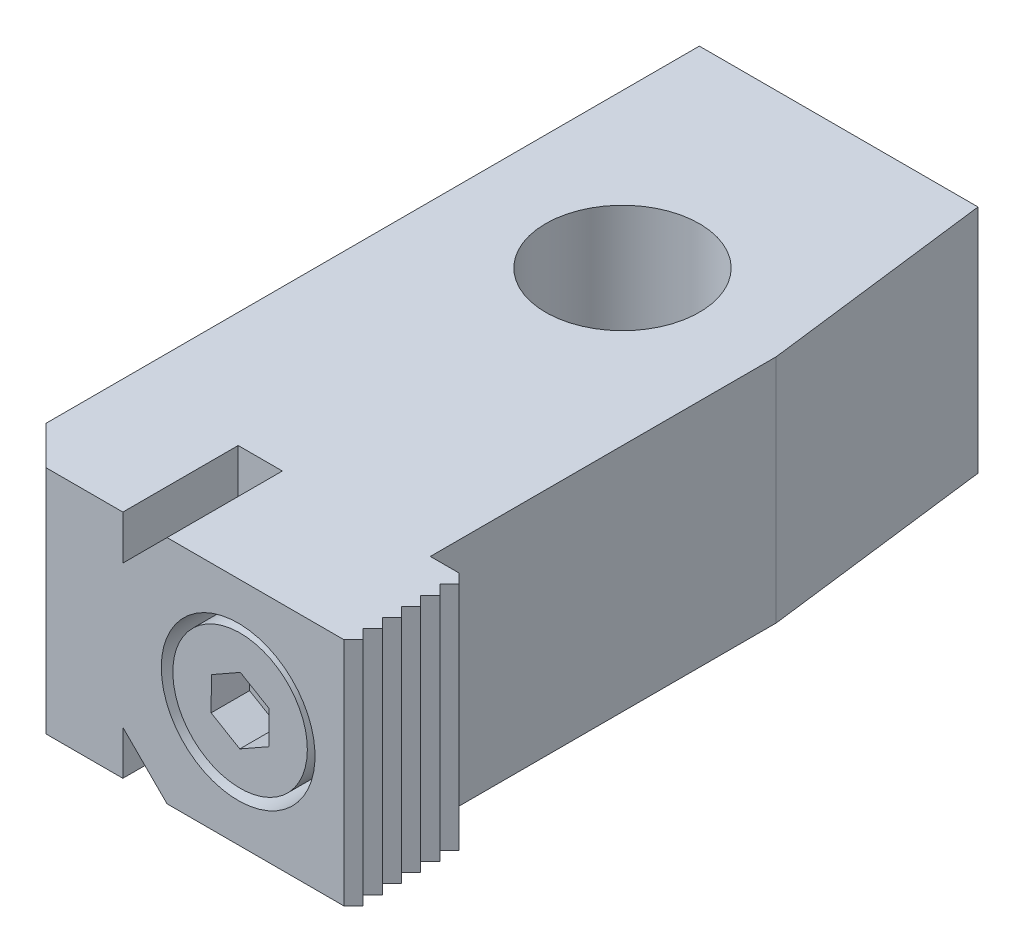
ISO-10303-21;
HEADER;
FILE_DESCRIPTION(('STEP AP214'),'2;1');
FILE_NAME('part.step','',(''),(''),'','','');
FILE_SCHEMA(('AUTOMOTIVE_DESIGN { 1 0 10303 214 1 1 1 1 }'));
ENDSEC;
DATA;
#1=APPLICATION_CONTEXT('core data for automotive mechanical design processes');
#2=APPLICATION_PROTOCOL_DEFINITION('international standard','automotive_design',2000,#1);
#3=PRODUCT_CONTEXT('',#1,'mechanical');
#4=PRODUCT('Part','Part','',(#3));
#5=PRODUCT_RELATED_PRODUCT_CATEGORY('part','',(#4));
#6=PRODUCT_DEFINITION_FORMATION('','',#4);
#7=PRODUCT_DEFINITION_CONTEXT('part definition',#1,'design');
#8=PRODUCT_DEFINITION('design','',#6,#7);
#9=PRODUCT_DEFINITION_SHAPE('','',#8);
#10=(LENGTH_UNIT() NAMED_UNIT(*) SI_UNIT(.MILLI.,.METRE.));
#11=(NAMED_UNIT(*) PLANE_ANGLE_UNIT() SI_UNIT($,.RADIAN.));
#12=(NAMED_UNIT(*) SI_UNIT($,.STERADIAN.) SOLID_ANGLE_UNIT());
#13=UNCERTAINTY_MEASURE_WITH_UNIT(LENGTH_MEASURE(1.E-05),#10,'distance_accuracy_value','');
#14=(GEOMETRIC_REPRESENTATION_CONTEXT(3) GLOBAL_UNCERTAINTY_ASSIGNED_CONTEXT((#13)) GLOBAL_UNIT_ASSIGNED_CONTEXT((#10,
#11,#12)) REPRESENTATION_CONTEXT('',''));
#15=CARTESIAN_POINT('',(0.,0.,0.));
#16=DIRECTION('',(0.,0.,1.));
#17=DIRECTION('',(1.,0.,0.));
#18=AXIS2_PLACEMENT_3D('',#15,#16,#17);
#19=CARTESIAN_POINT('',(4.,0.,19.9));
#20=DIRECTION('',(0.,0.,1.));
#21=DIRECTION('',(-1.,0.,0.));
#22=AXIS2_PLACEMENT_3D('',#19,#20,#21);
#23=PLANE('',#22);
#24=CARTESIAN_POINT('',(3.99999999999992,0.,19.9));
#25=DIRECTION('',(0.,0.,1.00000000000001));
#26=DIRECTION('',(0.999961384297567,-0.00878805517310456,0.));
#27=AXIS2_PLACEMENT_3D('',#24,#25,#26);
#28=CIRCLE('',#27,3.5);
#29=CARTESIAN_POINT('',(7.4998648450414,-0.0307581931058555,19.9));
#30=VERTEX_POINT('',#29);
#31=EDGE_CURVE('E955',#30,#30,#28,.T.);
#32=ORIENTED_EDGE('',*,*,#31,.F.);
#33=EDGE_LOOP('',(#32));
#34=FACE_BOUND('',#33,.T.);
#35=CARTESIAN_POINT('',(4.,0.,19.9));
#36=DIRECTION('',(0.,0.,1.));
#37=DIRECTION('',(-1.,0.,0.));
#38=AXIS2_PLACEMENT_3D('',#35,#36,#37);
#39=CIRCLE('',#38,4.);
#40=CARTESIAN_POINT('',(0.,0.,19.9));
#41=VERTEX_POINT('',#40);
#42=EDGE_CURVE('E361',#41,#41,#39,.T.);
#43=ORIENTED_EDGE('',*,*,#42,.T.);
#44=EDGE_LOOP('',(#43));
#45=FACE_BOUND('',#44,.T.);
#46=ADVANCED_FACE('F15',(#34,#45),#23,.T.);
#47=CARTESIAN_POINT('',(4.,0.,19.9));
#48=DIRECTION('',(0.,0.,1.));
#49=DIRECTION('',(-1.,0.,0.));
#50=AXIS2_PLACEMENT_3D('',#47,#48,#49);
#51=CYLINDRICAL_SURFACE('',#50,4.);
#52=ORIENTED_EDGE('',*,*,#42,.F.);
#53=EDGE_LOOP('',(#52));
#54=FACE_BOUND('',#53,.T.);
#55=CARTESIAN_POINT('',(4.,0.,24.));
#56=DIRECTION('',(0.,0.,1.));
#57=DIRECTION('',(-1.,0.,0.));
#58=AXIS2_PLACEMENT_3D('',#55,#56,#57);
#59=CIRCLE('',#58,4.);
#60=CARTESIAN_POINT('',(0.,0.,24.));
#61=VERTEX_POINT('',#60);
#62=EDGE_CURVE('E335',#61,#61,#59,.T.);
#63=ORIENTED_EDGE('',*,*,#62,.T.);
#64=EDGE_LOOP('',(#63));
#65=FACE_BOUND('',#64,.T.);
#66=ADVANCED_FACE('F579',(#54,#65),#51,.F.);
#67=CARTESIAN_POINT('',(10.,6.,24.));
#68=DIRECTION('',(0.,0.,1.));
#69=DIRECTION('',(-1.,0.,0.));
#70=AXIS2_PLACEMENT_3D('',#67,#68,#69);
#71=PLANE('',#70);
#72=DIRECTION('',(0.,1.,0.));
#73=VECTOR('',#72,1.);
#74=CARTESIAN_POINT('',(9.5,-6.,24.));
#75=LINE('',#74,#73);
#76=CARTESIAN_POINT('',(9.5,-6.,24.));
#77=VERTEX_POINT('',#76);
#78=CARTESIAN_POINT('',(9.5,6.,24.));
#79=VERTEX_POINT('',#78);
#80=EDGE_CURVE('E332',#77,#79,#75,.T.);
#81=ORIENTED_EDGE('',*,*,#80,.T.);
#82=DIRECTION('',(-1.,0.,0.));
#83=VECTOR('',#82,1.);
#84=CARTESIAN_POINT('',(10.,6.,24.));
#85=LINE('',#84,#83);
#86=CARTESIAN_POINT('',(0.3,6.,24.));
#87=VERTEX_POINT('',#86);
#88=EDGE_CURVE('E376',#79,#87,#85,.T.);
#89=ORIENTED_EDGE('',*,*,#88,.T.);
#90=DIRECTION('',(-0.707106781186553,-0.707106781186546,0.));
#91=VECTOR('',#90,1.);
#92=CARTESIAN_POINT('',(-2.,3.7,24.));
#93=LINE('',#92,#91);
#94=CARTESIAN_POINT('',(-2.,3.7,24.));
#95=VERTEX_POINT('',#94);
#96=EDGE_CURVE('E378',#87,#95,#93,.T.);
#97=ORIENTED_EDGE('',*,*,#96,.T.);
#98=DIRECTION('',(0.,-1.,0.));
#99=VECTOR('',#98,1.);
#100=CARTESIAN_POINT('',(-2.,6.,24.));
#101=LINE('',#100,#99);
#102=CARTESIAN_POINT('',(-2.,6.,24.));
#103=VERTEX_POINT('',#102);
#104=EDGE_CURVE('E244',#103,#95,#101,.T.);
#105=ORIENTED_EDGE('',*,*,#104,.F.);
#106=DIRECTION('',(1.,0.,0.));
#107=VECTOR('',#106,1.);
#108=CARTESIAN_POINT('',(-8.,6.,24.));
#109=LINE('',#108,#107);
#110=CARTESIAN_POINT('',(-6.,6.,24.));
#111=VERTEX_POINT('',#110);
#112=EDGE_CURVE('E224',#111,#103,#109,.T.);
#113=ORIENTED_EDGE('',*,*,#112,.F.);
#114=DIRECTION('',(0.,-1.,0.));
#115=VECTOR('',#114,1.);
#116=CARTESIAN_POINT('',(-6.,6.,24.));
#117=LINE('',#116,#115);
#118=CARTESIAN_POINT('',(-6.,-6.,24.));
#119=VERTEX_POINT('',#118);
#120=EDGE_CURVE('E248',#111,#119,#117,.T.);
#121=ORIENTED_EDGE('',*,*,#120,.T.);
#122=DIRECTION('',(1.,0.,0.));
#123=VECTOR('',#122,1.);
#124=CARTESIAN_POINT('',(-8.,-6.,24.));
#125=LINE('',#124,#123);
#126=CARTESIAN_POINT('',(-2.,-6.,24.));
#127=VERTEX_POINT('',#126);
#128=EDGE_CURVE('E419',#119,#127,#125,.T.);
#129=ORIENTED_EDGE('',*,*,#128,.T.);
#130=CARTESIAN_POINT('',(-2.,-3.7,24.));
#131=VERTEX_POINT('',#130);
#132=EDGE_CURVE('E243',#131,#127,#101,.T.);
#133=ORIENTED_EDGE('',*,*,#132,.F.);
#134=DIRECTION('',(0.707106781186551,-0.707106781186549,0.));
#135=VECTOR('',#134,1.);
#136=CARTESIAN_POINT('',(0.3,-6.,24.));
#137=LINE('',#136,#135);
#138=CARTESIAN_POINT('',(0.3,-6.,24.));
#139=VERTEX_POINT('',#138);
#140=EDGE_CURVE('E381',#131,#139,#137,.T.);
#141=ORIENTED_EDGE('',*,*,#140,.T.);
#142=DIRECTION('',(1.,0.,0.));
#143=VECTOR('',#142,1.);
#144=CARTESIAN_POINT('',(10.,-6.,24.));
#145=LINE('',#144,#143);
#146=EDGE_CURVE('E383',#139,#77,#145,.T.);
#147=ORIENTED_EDGE('',*,*,#146,.T.);
#148=EDGE_LOOP('',(#81,#89,#97,#105,#113,#121,#129,#133,#141,#147));
#149=FACE_BOUND('',#148,.T.);
#150=ORIENTED_EDGE('',*,*,#62,.F.);
#151=EDGE_LOOP('',(#150));
#152=FACE_BOUND('',#151,.T.);
#153=ADVANCED_FACE('F443',(#149,#152),#71,.T.);
#154=CARTESIAN_POINT('',(9.5,-6.,24.));
#155=DIRECTION('',(-0.707106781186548,0.,-0.707106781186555));
#156=DIRECTION('',(0.707106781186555,0.,-0.707106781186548));
#157=AXIS2_PLACEMENT_3D('',#154,#155,#156);
#158=PLANE('',#157);
#159=DIRECTION('',(-0.707106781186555,0.,0.707106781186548));
#160=VECTOR('',#159,1.);
#161=CARTESIAN_POINT('',(9.5,6.,24.));
#162=LINE('',#161,#160);
#163=CARTESIAN_POINT('',(10.,6.,23.5));
#164=VERTEX_POINT('',#163);
#165=EDGE_CURVE('E293',#164,#79,#162,.T.);
#166=ORIENTED_EDGE('',*,*,#165,.T.);
#167=ORIENTED_EDGE('',*,*,#80,.F.);
#168=DIRECTION('',(-0.707106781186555,0.,0.707106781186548));
#169=VECTOR('',#168,1.);
#170=CARTESIAN_POINT('',(9.5,-6.,24.));
#171=LINE('',#170,#169);
#172=CARTESIAN_POINT('',(10.,-6.,23.5));
#173=VERTEX_POINT('',#172);
#174=EDGE_CURVE('E328',#173,#77,#171,.T.);
#175=ORIENTED_EDGE('',*,*,#174,.F.);
#176=DIRECTION('',(0.,1.,0.));
#177=VECTOR('',#176,1.);
#178=CARTESIAN_POINT('',(10.,-6.,23.5));
#179=LINE('',#178,#177);
#180=EDGE_CURVE('E336',#173,#164,#179,.T.);
#181=ORIENTED_EDGE('',*,*,#180,.T.);
#182=EDGE_LOOP('',(#166,#167,#175,#181));
#183=FACE_BOUND('',#182,.T.);
#184=ADVANCED_FACE('F529',(#183),#158,.F.);
#185=CARTESIAN_POINT('',(10.,6.,24.));
#186=DIRECTION('',(0.,-1.,0.));
#187=DIRECTION('',(0.,0.,1.));
#188=AXIS2_PLACEMENT_3D('',#185,#186,#187);
#189=PLANE('',#188);
#190=ORIENTED_EDGE('',*,*,#88,.F.);
#191=ORIENTED_EDGE('',*,*,#165,.F.);
#192=DIRECTION('',(0.707106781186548,0.,0.707106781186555));
#193=VECTOR('',#192,1.);
#194=CARTESIAN_POINT('',(10.,6.,23.5));
#195=LINE('',#194,#193);
#196=CARTESIAN_POINT('',(9.5,6.,23.));
#197=VERTEX_POINT('',#196);
#198=EDGE_CURVE('E290',#197,#164,#195,.T.);
#199=ORIENTED_EDGE('',*,*,#198,.F.);
#200=DIRECTION('',(-0.707106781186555,0.,0.707106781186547));
#201=VECTOR('',#200,1.);
#202=CARTESIAN_POINT('',(9.5,6.,23.));
#203=LINE('',#202,#201);
#204=CARTESIAN_POINT('',(10.0000000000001,6.,22.5));
#205=VERTEX_POINT('',#204);
#206=EDGE_CURVE('E287',#205,#197,#203,.T.);
#207=ORIENTED_EDGE('',*,*,#206,.F.);
#208=DIRECTION('',(0.707106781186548,0.,0.707106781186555));
#209=VECTOR('',#208,1.);
#210=CARTESIAN_POINT('',(10.0000000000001,6.,22.5));
#211=LINE('',#210,#209);
#212=CARTESIAN_POINT('',(9.50000000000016,6.,22.));
#213=VERTEX_POINT('',#212);
#214=EDGE_CURVE('E284',#213,#205,#211,.T.);
#215=ORIENTED_EDGE('',*,*,#214,.F.);
#216=DIRECTION('',(-0.707106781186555,0.,0.707106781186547));
#217=VECTOR('',#216,1.);
#218=CARTESIAN_POINT('',(9.50000000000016,6.,22.));
#219=LINE('',#218,#217);
#220=CARTESIAN_POINT('',(10.0000000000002,6.,21.5));
#221=VERTEX_POINT('',#220);
#222=EDGE_CURVE('E281',#221,#213,#219,.T.);
#223=ORIENTED_EDGE('',*,*,#222,.F.);
#224=DIRECTION('',(0.707106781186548,0.,0.707106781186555));
#225=VECTOR('',#224,1.);
#226=CARTESIAN_POINT('',(10.0000000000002,6.,21.5));
#227=LINE('',#226,#225);
#228=CARTESIAN_POINT('',(9.5,6.,21.));
#229=VERTEX_POINT('',#228);
#230=EDGE_CURVE('E278',#229,#221,#227,.T.);
#231=ORIENTED_EDGE('',*,*,#230,.F.);
#232=DIRECTION('',(-0.707106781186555,0.,0.707106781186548));
#233=VECTOR('',#232,1.);
#234=CARTESIAN_POINT('',(9.5,6.,21.));
#235=LINE('',#234,#233);
#236=CARTESIAN_POINT('',(10.0000000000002,6.,20.5));
#237=VERTEX_POINT('',#236);
#238=EDGE_CURVE('E275',#237,#229,#235,.T.);
#239=ORIENTED_EDGE('',*,*,#238,.F.);
#240=DIRECTION('',(0.707106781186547,0.,0.707106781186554));
#241=VECTOR('',#240,1.);
#242=CARTESIAN_POINT('',(10.0000000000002,6.,20.5));
#243=LINE('',#242,#241);
#244=CARTESIAN_POINT('',(9.5,6.,20.));
#245=VERTEX_POINT('',#244);
#246=EDGE_CURVE('E272',#245,#237,#243,.T.);
#247=ORIENTED_EDGE('',*,*,#246,.F.);
#248=DIRECTION('',(-0.707106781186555,0.,0.707106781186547));
#249=VECTOR('',#248,1.);
#250=CARTESIAN_POINT('',(9.5,6.,20.));
#251=LINE('',#250,#249);
#252=CARTESIAN_POINT('',(10.,6.,19.5));
#253=VERTEX_POINT('',#252);
#254=EDGE_CURVE('E269',#253,#245,#251,.T.);
#255=ORIENTED_EDGE('',*,*,#254,.F.);
#256=DIRECTION('',(0.707106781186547,0.,0.707106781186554));
#257=VECTOR('',#256,1.);
#258=CARTESIAN_POINT('',(10.,6.,19.5));
#259=LINE('',#258,#257);
#260=CARTESIAN_POINT('',(9.5,6.,19.));
#261=VERTEX_POINT('',#260);
#262=EDGE_CURVE('E263',#261,#253,#259,.T.);
#263=ORIENTED_EDGE('',*,*,#262,.F.);
#264=DIRECTION('',(-0.707106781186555,0.,0.707106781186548));
#265=VECTOR('',#264,1.);
#266=CARTESIAN_POINT('',(9.5,6.,19.));
#267=LINE('',#266,#265);
#268=CARTESIAN_POINT('',(10.,6.,18.5));
#269=VERTEX_POINT('',#268);
#270=EDGE_CURVE('E256',#269,#261,#267,.T.);
#271=ORIENTED_EDGE('',*,*,#270,.F.);
#272=DIRECTION('',(0.707106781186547,0.,0.707106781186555));
#273=VECTOR('',#272,1.);
#274=CARTESIAN_POINT('',(10.,6.,18.5));
#275=LINE('',#274,#273);
#276=CARTESIAN_POINT('',(9.5,6.,18.));
#277=VERTEX_POINT('',#276);
#278=EDGE_CURVE('E252',#277,#269,#275,.T.);
#279=ORIENTED_EDGE('',*,*,#278,.F.);
#280=DIRECTION('',(-1.,0.,0.));
#281=VECTOR('',#280,1.);
#282=CARTESIAN_POINT('',(10.,6.,18.));
#283=LINE('',#282,#281);
#284=CARTESIAN_POINT('',(8.,6.,18.));
#285=VERTEX_POINT('',#284);
#286=EDGE_CURVE('E367',#277,#285,#283,.T.);
#287=ORIENTED_EDGE('',*,*,#286,.T.);
#288=DIRECTION('',(0.,0.,-1.));
#289=VECTOR('',#288,1.);
#290=CARTESIAN_POINT('',(8.,6.,-12.));
#291=LINE('',#290,#289);
#292=CARTESIAN_POINT('',(8.,6.,0.));
#293=VERTEX_POINT('',#292);
#294=EDGE_CURVE('E217',#285,#293,#291,.T.);
#295=ORIENTED_EDGE('',*,*,#294,.T.);
#296=DIRECTION('',(-0.124034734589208,0.,-0.992277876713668));
#297=VECTOR('',#296,1.);
#298=CARTESIAN_POINT('',(6.5,6.,-12.));
#299=LINE('',#298,#297);
#300=CARTESIAN_POINT('',(6.5,6.,-12.));
#301=VERTEX_POINT('',#300);
#302=EDGE_CURVE('E199',#293,#301,#299,.T.);
#303=ORIENTED_EDGE('',*,*,#302,.T.);
#304=DIRECTION('',(-1.,0.,0.));
#305=VECTOR('',#304,1.);
#306=CARTESIAN_POINT('',(8.,6.,-12.));
#307=LINE('',#306,#305);
#308=CARTESIAN_POINT('',(-8.,6.,-12.));
#309=VERTEX_POINT('',#308);
#310=EDGE_CURVE('E213',#301,#309,#307,.T.);
#311=ORIENTED_EDGE('',*,*,#310,.T.);
#312=DIRECTION('',(0.,0.,1.));
#313=VECTOR('',#312,1.);
#314=CARTESIAN_POINT('',(-8.,6.,-12.));
#315=LINE('',#314,#313);
#316=CARTESIAN_POINT('',(-8.,6.,22.));
#317=VERTEX_POINT('',#316);
#318=EDGE_CURVE('E222',#309,#317,#315,.T.);
#319=ORIENTED_EDGE('',*,*,#318,.T.);
#320=DIRECTION('',(-0.707106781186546,0.,-0.707106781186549));
#321=VECTOR('',#320,1.);
#322=CARTESIAN_POINT('',(-6.,6.,24.));
#323=LINE('',#322,#321);
#324=EDGE_CURVE('E19',#317,#111,#323,.F.);
#325=ORIENTED_EDGE('',*,*,#324,.T.);
#326=ORIENTED_EDGE('',*,*,#112,.T.);
#327=DIRECTION('',(0.,0.,-1.));
#328=VECTOR('',#327,1.);
#329=CARTESIAN_POINT('',(-2.,6.,24.));
#330=LINE('',#329,#328);
#331=CARTESIAN_POINT('',(-2.,6.,18.));
#332=VERTEX_POINT('',#331);
#333=EDGE_CURVE('E231',#103,#332,#330,.T.);
#334=ORIENTED_EDGE('',*,*,#333,.T.);
#335=DIRECTION('',(1.,0.,0.));
#336=VECTOR('',#335,1.);
#337=CARTESIAN_POINT('',(8.,6.,18.));
#338=LINE('',#337,#336);
#339=CARTESIAN_POINT('',(0.3,6.,18.));
#340=VERTEX_POINT('',#339);
#341=EDGE_CURVE('E233',#332,#340,#338,.T.);
#342=ORIENTED_EDGE('',*,*,#341,.T.);
#343=DIRECTION('',(0.,0.,-1.));
#344=VECTOR('',#343,1.);
#345=CARTESIAN_POINT('',(0.3,6.,24.));
#346=LINE('',#345,#344);
#347=EDGE_CURVE('E239',#87,#340,#346,.T.);
#348=ORIENTED_EDGE('',*,*,#347,.F.);
#349=EDGE_LOOP('',(#190,#191,#199,#207,#215,#223,#231,#239,#247,#255,#263,#271,#279,#287,#295,
#303,#311,#319,#325,#326,#334,#342,#348));
#350=FACE_BOUND('',#349,.T.);
#351=CARTESIAN_POINT('',(0.,6.,0.));
#352=DIRECTION('',(0.,1.,0.));
#353=DIRECTION('',(-1.,0.,0.));
#354=AXIS2_PLACEMENT_3D('',#351,#352,#353);
#355=CIRCLE('',#354,4.);
#356=CARTESIAN_POINT('',(-4.,6.,0.));
#357=VERTEX_POINT('',#356);
#358=EDGE_CURVE('E409',#357,#357,#355,.T.);
#359=ORIENTED_EDGE('',*,*,#358,.F.);
#360=EDGE_LOOP('',(#359));
#361=FACE_BOUND('',#360,.T.);
#362=ADVANCED_FACE('F211',(#350,#361),#189,.F.);
#363=CARTESIAN_POINT('',(-2.,3.7,24.));
#364=DIRECTION('',(0.707106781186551,-0.707106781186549,0.));
#365=DIRECTION('',(0.707106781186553,0.707106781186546,0.));
#366=AXIS2_PLACEMENT_3D('',#363,#364,#365);
#367=PLANE('',#366);
#368=DIRECTION('',(-0.707106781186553,-0.707106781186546,0.));
#369=VECTOR('',#368,1.);
#370=CARTESIAN_POINT('',(-2.,3.7,18.));
#371=LINE('',#370,#369);
#372=CARTESIAN_POINT('',(-2.,3.7,18.));
#373=VERTEX_POINT('',#372);
#374=EDGE_CURVE('E369',#340,#373,#371,.T.);
#375=ORIENTED_EDGE('',*,*,#374,.T.);
#376=DIRECTION('',(0.,0.,-1.));
#377=VECTOR('',#376,1.);
#378=CARTESIAN_POINT('',(-2.,3.7,24.));
#379=LINE('',#378,#377);
#380=EDGE_CURVE('E391',#95,#373,#379,.T.);
#381=ORIENTED_EDGE('',*,*,#380,.F.);
#382=ORIENTED_EDGE('',*,*,#96,.F.);
#383=ORIENTED_EDGE('',*,*,#347,.T.);
#384=EDGE_LOOP('',(#375,#381,#382,#383));
#385=FACE_BOUND('',#384,.T.);
#386=ADVANCED_FACE('F584',(#385),#367,.F.);
#387=CARTESIAN_POINT('',(0.3,-6.,24.));
#388=DIRECTION('',(0.707106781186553,0.707106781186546,0.));
#389=DIRECTION('',(-0.707106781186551,0.707106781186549,0.));
#390=AXIS2_PLACEMENT_3D('',#387,#388,#389);
#391=PLANE('',#390);
#392=DIRECTION('',(0.707106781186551,-0.707106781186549,0.));
#393=VECTOR('',#392,1.);
#394=CARTESIAN_POINT('',(0.3,-6.,18.));
#395=LINE('',#394,#393);
#396=CARTESIAN_POINT('',(-2.,-3.7,18.));
#397=VERTEX_POINT('',#396);
#398=CARTESIAN_POINT('',(0.3,-6.,18.));
#399=VERTEX_POINT('',#398);
#400=EDGE_CURVE('E372',#397,#399,#395,.T.);
#401=ORIENTED_EDGE('',*,*,#400,.T.);
#402=DIRECTION('',(0.,0.,-1.));
#403=VECTOR('',#402,1.);
#404=CARTESIAN_POINT('',(0.3,-6.,24.));
#405=LINE('',#404,#403);
#406=EDGE_CURVE('E386',#139,#399,#405,.T.);
#407=ORIENTED_EDGE('',*,*,#406,.F.);
#408=ORIENTED_EDGE('',*,*,#140,.F.);
#409=DIRECTION('',(0.,0.,-1.));
#410=VECTOR('',#409,1.);
#411=CARTESIAN_POINT('',(-2.,-3.7,24.));
#412=LINE('',#411,#410);
#413=EDGE_CURVE('E389',#131,#397,#412,.T.);
#414=ORIENTED_EDGE('',*,*,#413,.T.);
#415=EDGE_LOOP('',(#401,#407,#408,#414));
#416=FACE_BOUND('',#415,.T.);
#417=ADVANCED_FACE('F438',(#416),#391,.F.);
#418=CARTESIAN_POINT('',(10.,-6.,24.));
#419=DIRECTION('',(0.,1.,0.));
#420=DIRECTION('',(0.,0.,-1.));
#421=AXIS2_PLACEMENT_3D('',#418,#419,#420);
#422=PLANE('',#421);
#423=DIRECTION('',(0.707106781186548,0.,0.707106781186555));
#424=VECTOR('',#423,1.);
#425=CARTESIAN_POINT('',(10.,-6.,23.5));
#426=LINE('',#425,#424);
#427=CARTESIAN_POINT('',(9.5,-6.,23.));
#428=VERTEX_POINT('',#427);
#429=EDGE_CURVE('E325',#428,#173,#426,.T.);
#430=ORIENTED_EDGE('',*,*,#429,.T.);
#431=ORIENTED_EDGE('',*,*,#174,.T.);
#432=ORIENTED_EDGE('',*,*,#146,.F.);
#433=ORIENTED_EDGE('',*,*,#406,.T.);
#434=DIRECTION('',(1.,0.,0.));
#435=VECTOR('',#434,1.);
#436=CARTESIAN_POINT('',(8.,-6.,18.));
#437=LINE('',#436,#435);
#438=CARTESIAN_POINT('',(-2.,-6.,18.));
#439=VERTEX_POINT('',#438);
#440=EDGE_CURVE('E226',#439,#399,#437,.T.);
#441=ORIENTED_EDGE('',*,*,#440,.F.);
#442=DIRECTION('',(0.,0.,-1.));
#443=VECTOR('',#442,1.);
#444=CARTESIAN_POINT('',(-2.,-6.,24.));
#445=LINE('',#444,#443);
#446=EDGE_CURVE('E422',#127,#439,#445,.T.);
#447=ORIENTED_EDGE('',*,*,#446,.F.);
#448=ORIENTED_EDGE('',*,*,#128,.F.);
#449=DIRECTION('',(0.707106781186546,0.,0.707106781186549));
#450=VECTOR('',#449,1.);
#451=CARTESIAN_POINT('',(-2.,-6.,28.));
#452=LINE('',#451,#450);
#453=CARTESIAN_POINT('',(-8.,-6.,22.));
#454=VERTEX_POINT('',#453);
#455=EDGE_CURVE('E251',#119,#454,#452,.F.);
#456=ORIENTED_EDGE('',*,*,#455,.T.);
#457=DIRECTION('',(0.,0.,1.));
#458=VECTOR('',#457,1.);
#459=CARTESIAN_POINT('',(-8.,-6.,-12.));
#460=LINE('',#459,#458);
#461=CARTESIAN_POINT('',(-8.,-6.,-12.));
#462=VERTEX_POINT('',#461);
#463=EDGE_CURVE('E417',#462,#454,#460,.T.);
#464=ORIENTED_EDGE('',*,*,#463,.F.);
#465=DIRECTION('',(-1.,0.,0.));
#466=VECTOR('',#465,1.);
#467=CARTESIAN_POINT('',(8.,-6.,-12.));
#468=LINE('',#467,#466);
#469=CARTESIAN_POINT('',(6.5,-6.,-12.));
#470=VERTEX_POINT('',#469);
#471=EDGE_CURVE('E415',#470,#462,#468,.T.);
#472=ORIENTED_EDGE('',*,*,#471,.F.);
#473=DIRECTION('',(-0.124034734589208,0.,-0.992277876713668));
#474=VECTOR('',#473,1.);
#475=CARTESIAN_POINT('',(6.5,-6.,-12.));
#476=LINE('',#475,#474);
#477=CARTESIAN_POINT('',(8.,-6.,0.));
#478=VERTEX_POINT('',#477);
#479=EDGE_CURVE('E202',#478,#470,#476,.T.);
#480=ORIENTED_EDGE('',*,*,#479,.F.);
#481=DIRECTION('',(0.,0.,-1.));
#482=VECTOR('',#481,1.);
#483=CARTESIAN_POINT('',(8.,-6.,-12.));
#484=LINE('',#483,#482);
#485=CARTESIAN_POINT('',(8.,-6.,18.));
#486=VERTEX_POINT('',#485);
#487=EDGE_CURVE('E412',#486,#478,#484,.T.);
#488=ORIENTED_EDGE('',*,*,#487,.F.);
#489=DIRECTION('',(1.,0.,0.));
#490=VECTOR('',#489,1.);
#491=CARTESIAN_POINT('',(10.,-6.,18.));
#492=LINE('',#491,#490);
#493=CARTESIAN_POINT('',(9.5,-6.,18.));
#494=VERTEX_POINT('',#493);
#495=EDGE_CURVE('E374',#486,#494,#492,.T.);
#496=ORIENTED_EDGE('',*,*,#495,.T.);
#497=DIRECTION('',(0.707106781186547,0.,0.707106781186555));
#498=VECTOR('',#497,1.);
#499=CARTESIAN_POINT('',(10.,-6.,18.5));
#500=LINE('',#499,#498);
#501=CARTESIAN_POINT('',(10.,-6.,18.5));
#502=VERTEX_POINT('',#501);
#503=EDGE_CURVE('E295',#494,#502,#500,.T.);
#504=ORIENTED_EDGE('',*,*,#503,.T.);
#505=DIRECTION('',(-0.707106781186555,0.,0.707106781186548));
#506=VECTOR('',#505,1.);
#507=CARTESIAN_POINT('',(9.5,-6.,19.));
#508=LINE('',#507,#506);
#509=CARTESIAN_POINT('',(9.5,-6.,19.));
#510=VERTEX_POINT('',#509);
#511=EDGE_CURVE('E298',#502,#510,#508,.T.);
#512=ORIENTED_EDGE('',*,*,#511,.T.);
#513=DIRECTION('',(0.707106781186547,0.,0.707106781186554));
#514=VECTOR('',#513,1.);
#515=CARTESIAN_POINT('',(10.,-6.,19.5));
#516=LINE('',#515,#514);
#517=CARTESIAN_POINT('',(10.,-6.,19.5));
#518=VERTEX_POINT('',#517);
#519=EDGE_CURVE('E301',#510,#518,#516,.T.);
#520=ORIENTED_EDGE('',*,*,#519,.T.);
#521=DIRECTION('',(-0.707106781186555,0.,0.707106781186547));
#522=VECTOR('',#521,1.);
#523=CARTESIAN_POINT('',(9.5,-6.,20.));
#524=LINE('',#523,#522);
#525=CARTESIAN_POINT('',(9.5,-6.,20.));
#526=VERTEX_POINT('',#525);
#527=EDGE_CURVE('E304',#518,#526,#524,.T.);
#528=ORIENTED_EDGE('',*,*,#527,.T.);
#529=DIRECTION('',(0.707106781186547,0.,0.707106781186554));
#530=VECTOR('',#529,1.);
#531=CARTESIAN_POINT('',(10.,-6.,20.5));
#532=LINE('',#531,#530);
#533=CARTESIAN_POINT('',(10.,-6.,20.5));
#534=VERTEX_POINT('',#533);
#535=EDGE_CURVE('E307',#526,#534,#532,.T.);
#536=ORIENTED_EDGE('',*,*,#535,.T.);
#537=DIRECTION('',(-0.707106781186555,0.,0.707106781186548));
#538=VECTOR('',#537,1.);
#539=CARTESIAN_POINT('',(9.5,-6.,21.));
#540=LINE('',#539,#538);
#541=CARTESIAN_POINT('',(9.5,-6.,21.));
#542=VERTEX_POINT('',#541);
#543=EDGE_CURVE('E310',#534,#542,#540,.T.);
#544=ORIENTED_EDGE('',*,*,#543,.T.);
#545=DIRECTION('',(0.707106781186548,0.,0.707106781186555));
#546=VECTOR('',#545,1.);
#547=CARTESIAN_POINT('',(10.,-6.,21.5));
#548=LINE('',#547,#546);
#549=CARTESIAN_POINT('',(10.,-6.,21.5));
#550=VERTEX_POINT('',#549);
#551=EDGE_CURVE('E313',#542,#550,#548,.T.);
#552=ORIENTED_EDGE('',*,*,#551,.T.);
#553=DIRECTION('',(-0.707106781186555,0.,0.707106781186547));
#554=VECTOR('',#553,1.);
#555=CARTESIAN_POINT('',(9.5,-6.,22.));
#556=LINE('',#555,#554);
#557=CARTESIAN_POINT('',(9.5,-6.,22.));
#558=VERTEX_POINT('',#557);
#559=EDGE_CURVE('E316',#550,#558,#556,.T.);
#560=ORIENTED_EDGE('',*,*,#559,.T.);
#561=DIRECTION('',(0.707106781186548,0.,0.707106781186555));
#562=VECTOR('',#561,1.);
#563=CARTESIAN_POINT('',(10.,-6.,22.5));
#564=LINE('',#563,#562);
#565=CARTESIAN_POINT('',(10.,-6.,22.5));
#566=VERTEX_POINT('',#565);
#567=EDGE_CURVE('E319',#558,#566,#564,.T.);
#568=ORIENTED_EDGE('',*,*,#567,.T.);
#569=DIRECTION('',(-0.707106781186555,0.,0.707106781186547));
#570=VECTOR('',#569,1.);
#571=CARTESIAN_POINT('',(9.5,-6.,23.));
#572=LINE('',#571,#570);
#573=EDGE_CURVE('E322',#566,#428,#572,.T.);
#574=ORIENTED_EDGE('',*,*,#573,.T.);
#575=EDGE_LOOP('',(#430,#431,#432,#433,#441,#447,#448,#456,#464,#472,#480,#488,#496,#504,#512,
#520,#528,#536,#544,#552,#560,#568,#574));
#576=FACE_BOUND('',#575,.T.);
#577=CARTESIAN_POINT('',(0.,-6.,0.));
#578=DIRECTION('',(0.,1.,0.));
#579=DIRECTION('',(-1.,0.,0.));
#580=AXIS2_PLACEMENT_3D('',#577,#578,#579);
#581=CIRCLE('',#580,4.);
#582=CARTESIAN_POINT('',(-4.,-6.,0.));
#583=VERTEX_POINT('',#582);
#584=EDGE_CURVE('E406',#583,#583,#581,.T.);
#585=ORIENTED_EDGE('',*,*,#584,.T.);
#586=EDGE_LOOP('',(#585));
#587=FACE_BOUND('',#586,.T.);
#588=ADVANCED_FACE('F434',(#576,#587),#422,.F.);
#589=CARTESIAN_POINT('',(10.,-6.,23.5));
#590=DIRECTION('',(-0.707106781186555,0.,0.707106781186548));
#591=DIRECTION('',(-0.707106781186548,0.,-0.707106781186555));
#592=AXIS2_PLACEMENT_3D('',#589,#590,#591);
#593=PLANE('',#592);
#594=ORIENTED_EDGE('',*,*,#198,.T.);
#595=ORIENTED_EDGE('',*,*,#180,.F.);
#596=ORIENTED_EDGE('',*,*,#429,.F.);
#597=DIRECTION('',(0.,1.,0.));
#598=VECTOR('',#597,1.);
#599=CARTESIAN_POINT('',(9.5,-6.,23.));
#600=LINE('',#599,#598);
#601=EDGE_CURVE('E338',#428,#197,#600,.T.);
#602=ORIENTED_EDGE('',*,*,#601,.T.);
#603=EDGE_LOOP('',(#594,#595,#596,#602));
#604=FACE_BOUND('',#603,.T.);
#605=ADVANCED_FACE('F533',(#604),#593,.F.);
#606=CARTESIAN_POINT('',(9.5,-6.,23.));
#607=DIRECTION('',(-0.707106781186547,0.,-0.707106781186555));
#608=DIRECTION('',(0.707106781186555,0.,-0.707106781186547));
#609=AXIS2_PLACEMENT_3D('',#606,#607,#608);
#610=PLANE('',#609);
#611=ORIENTED_EDGE('',*,*,#206,.T.);
#612=ORIENTED_EDGE('',*,*,#601,.F.);
#613=ORIENTED_EDGE('',*,*,#573,.F.);
#614=DIRECTION('',(0.,1.,0.));
#615=VECTOR('',#614,1.);
#616=CARTESIAN_POINT('',(10.,-6.,22.5));
#617=LINE('',#616,#615);
#618=EDGE_CURVE('E340',#566,#205,#617,.T.);
#619=ORIENTED_EDGE('',*,*,#618,.T.);
#620=EDGE_LOOP('',(#611,#612,#613,#619));
#621=FACE_BOUND('',#620,.T.);
#622=ADVANCED_FACE('F536',(#621),#610,.F.);
#623=CARTESIAN_POINT('',(10.,-6.,22.5));
#624=DIRECTION('',(-0.707106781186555,0.,0.707106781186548));
#625=DIRECTION('',(-0.707106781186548,0.,-0.707106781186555));
#626=AXIS2_PLACEMENT_3D('',#623,#624,#625);
#627=PLANE('',#626);
#628=ORIENTED_EDGE('',*,*,#214,.T.);
#629=ORIENTED_EDGE('',*,*,#618,.F.);
#630=ORIENTED_EDGE('',*,*,#567,.F.);
#631=DIRECTION('',(0.,1.,0.));
#632=VECTOR('',#631,1.);
#633=CARTESIAN_POINT('',(9.5,-6.,22.));
#634=LINE('',#633,#632);
#635=EDGE_CURVE('E342',#558,#213,#634,.T.);
#636=ORIENTED_EDGE('',*,*,#635,.T.);
#637=EDGE_LOOP('',(#628,#629,#630,#636));
#638=FACE_BOUND('',#637,.T.);
#639=ADVANCED_FACE('F540',(#638),#627,.F.);
#640=CARTESIAN_POINT('',(9.5,-6.,22.));
#641=DIRECTION('',(-0.707106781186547,0.,-0.707106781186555));
#642=DIRECTION('',(0.707106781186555,0.,-0.707106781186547));
#643=AXIS2_PLACEMENT_3D('',#640,#641,#642);
#644=PLANE('',#643);
#645=ORIENTED_EDGE('',*,*,#222,.T.);
#646=ORIENTED_EDGE('',*,*,#635,.F.);
#647=ORIENTED_EDGE('',*,*,#559,.F.);
#648=DIRECTION('',(0.,1.,0.));
#649=VECTOR('',#648,1.);
#650=CARTESIAN_POINT('',(10.,-6.,21.5));
#651=LINE('',#650,#649);
#652=EDGE_CURVE('E344',#550,#221,#651,.T.);
#653=ORIENTED_EDGE('',*,*,#652,.T.);
#654=EDGE_LOOP('',(#645,#646,#647,#653));
#655=FACE_BOUND('',#654,.T.);
#656=ADVANCED_FACE('F544',(#655),#644,.F.);
#657=CARTESIAN_POINT('',(10.,-6.,21.5));
#658=DIRECTION('',(-0.707106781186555,0.,0.707106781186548));
#659=DIRECTION('',(-0.707106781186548,0.,-0.707106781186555));
#660=AXIS2_PLACEMENT_3D('',#657,#658,#659);
#661=PLANE('',#660);
#662=ORIENTED_EDGE('',*,*,#230,.T.);
#663=ORIENTED_EDGE('',*,*,#652,.F.);
#664=ORIENTED_EDGE('',*,*,#551,.F.);
#665=DIRECTION('',(0.,1.,0.));
#666=VECTOR('',#665,1.);
#667=CARTESIAN_POINT('',(9.5,-6.,21.));
#668=LINE('',#667,#666);
#669=EDGE_CURVE('E346',#542,#229,#668,.T.);
#670=ORIENTED_EDGE('',*,*,#669,.T.);
#671=EDGE_LOOP('',(#662,#663,#664,#670));
#672=FACE_BOUND('',#671,.T.);
#673=ADVANCED_FACE('F548',(#672),#661,.F.);
#674=CARTESIAN_POINT('',(9.5,-6.,21.));
#675=DIRECTION('',(-0.707106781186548,0.,-0.707106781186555));
#676=DIRECTION('',(0.707106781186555,0.,-0.707106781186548));
#677=AXIS2_PLACEMENT_3D('',#674,#675,#676);
#678=PLANE('',#677);
#679=ORIENTED_EDGE('',*,*,#238,.T.);
#680=ORIENTED_EDGE('',*,*,#669,.F.);
#681=ORIENTED_EDGE('',*,*,#543,.F.);
#682=DIRECTION('',(0.,1.,0.));
#683=VECTOR('',#682,1.);
#684=CARTESIAN_POINT('',(10.,-6.,20.5));
#685=LINE('',#684,#683);
#686=EDGE_CURVE('E348',#534,#237,#685,.T.);
#687=ORIENTED_EDGE('',*,*,#686,.T.);
#688=EDGE_LOOP('',(#679,#680,#681,#687));
#689=FACE_BOUND('',#688,.T.);
#690=ADVANCED_FACE('F552',(#689),#678,.F.);
#691=CARTESIAN_POINT('',(10.,-6.,20.5));
#692=DIRECTION('',(-0.707106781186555,0.,0.707106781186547));
#693=DIRECTION('',(-0.707106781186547,0.,-0.707106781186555));
#694=AXIS2_PLACEMENT_3D('',#691,#692,#693);
#695=PLANE('',#694);
#696=ORIENTED_EDGE('',*,*,#246,.T.);
#697=ORIENTED_EDGE('',*,*,#686,.F.);
#698=ORIENTED_EDGE('',*,*,#535,.F.);
#699=DIRECTION('',(0.,1.,0.));
#700=VECTOR('',#699,1.);
#701=CARTESIAN_POINT('',(9.5,-6.,20.));
#702=LINE('',#701,#700);
#703=EDGE_CURVE('E350',#526,#245,#702,.T.);
#704=ORIENTED_EDGE('',*,*,#703,.T.);
#705=EDGE_LOOP('',(#696,#697,#698,#704));
#706=FACE_BOUND('',#705,.T.);
#707=ADVANCED_FACE('F556',(#706),#695,.F.);
#708=CARTESIAN_POINT('',(9.5,-6.,20.));
#709=DIRECTION('',(-0.707106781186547,0.,-0.707106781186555));
#710=DIRECTION('',(0.707106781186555,0.,-0.707106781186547));
#711=AXIS2_PLACEMENT_3D('',#708,#709,#710);
#712=PLANE('',#711);
#713=ORIENTED_EDGE('',*,*,#254,.T.);
#714=ORIENTED_EDGE('',*,*,#703,.F.);
#715=ORIENTED_EDGE('',*,*,#527,.F.);
#716=DIRECTION('',(0.,1.,0.));
#717=VECTOR('',#716,1.);
#718=CARTESIAN_POINT('',(10.,-6.,19.5));
#719=LINE('',#718,#717);
#720=EDGE_CURVE('E352',#518,#253,#719,.T.);
#721=ORIENTED_EDGE('',*,*,#720,.T.);
#722=EDGE_LOOP('',(#713,#714,#715,#721));
#723=FACE_BOUND('',#722,.T.);
#724=ADVANCED_FACE('F560',(#723),#712,.F.);
#725=CARTESIAN_POINT('',(10.,-6.,19.5));
#726=DIRECTION('',(-0.707106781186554,0.,0.707106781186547));
#727=DIRECTION('',(-0.707106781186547,0.,-0.707106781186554));
#728=AXIS2_PLACEMENT_3D('',#725,#726,#727);
#729=PLANE('',#728);
#730=ORIENTED_EDGE('',*,*,#262,.T.);
#731=ORIENTED_EDGE('',*,*,#720,.F.);
#732=ORIENTED_EDGE('',*,*,#519,.F.);
#733=DIRECTION('',(0.,1.,0.));
#734=VECTOR('',#733,1.);
#735=CARTESIAN_POINT('',(9.5,-6.,19.));
#736=LINE('',#735,#734);
#737=EDGE_CURVE('E354',#510,#261,#736,.T.);
#738=ORIENTED_EDGE('',*,*,#737,.T.);
#739=EDGE_LOOP('',(#730,#731,#732,#738));
#740=FACE_BOUND('',#739,.T.);
#741=ADVANCED_FACE('F564',(#740),#729,.F.);
#742=CARTESIAN_POINT('',(9.5,-6.,19.));
#743=DIRECTION('',(-0.707106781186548,0.,-0.707106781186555));
#744=DIRECTION('',(0.707106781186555,0.,-0.707106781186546));
#745=AXIS2_PLACEMENT_3D('',#742,#743,#744);
#746=PLANE('',#745);
#747=ORIENTED_EDGE('',*,*,#270,.T.);
#748=ORIENTED_EDGE('',*,*,#737,.F.);
#749=ORIENTED_EDGE('',*,*,#511,.F.);
#750=DIRECTION('',(0.,1.,0.));
#751=VECTOR('',#750,1.);
#752=CARTESIAN_POINT('',(10.,-6.,18.5));
#753=LINE('',#752,#751);
#754=EDGE_CURVE('E356',#502,#269,#753,.T.);
#755=ORIENTED_EDGE('',*,*,#754,.T.);
#756=EDGE_LOOP('',(#747,#748,#749,#755));
#757=FACE_BOUND('',#756,.T.);
#758=ADVANCED_FACE('F568',(#757),#746,.F.);
#759=CARTESIAN_POINT('',(10.,-6.,18.5));
#760=DIRECTION('',(-0.707106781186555,0.,0.707106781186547));
#761=DIRECTION('',(-0.707106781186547,0.,-0.707106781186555));
#762=AXIS2_PLACEMENT_3D('',#759,#760,#761);
#763=PLANE('',#762);
#764=ORIENTED_EDGE('',*,*,#278,.T.);
#765=ORIENTED_EDGE('',*,*,#754,.F.);
#766=ORIENTED_EDGE('',*,*,#503,.F.);
#767=DIRECTION('',(0.,1.,0.));
#768=VECTOR('',#767,1.);
#769=CARTESIAN_POINT('',(9.5,-6.,18.));
#770=LINE('',#769,#768);
#771=EDGE_CURVE('E331',#494,#277,#770,.T.);
#772=ORIENTED_EDGE('',*,*,#771,.T.);
#773=EDGE_LOOP('',(#764,#765,#766,#772));
#774=FACE_BOUND('',#773,.T.);
#775=ADVANCED_FACE('F572',(#774),#763,.F.);
#776=CARTESIAN_POINT('',(10.,6.,18.));
#777=DIRECTION('',(0.,0.,1.));
#778=DIRECTION('',(-1.,0.,0.));
#779=AXIS2_PLACEMENT_3D('',#776,#777,#778);
#780=PLANE('',#779);
#781=DIRECTION('',(0.,-1.,0.));
#782=VECTOR('',#781,1.);
#783=CARTESIAN_POINT('',(8.,6.,18.));
#784=LINE('',#783,#782);
#785=EDGE_CURVE('E237',#285,#486,#784,.T.);
#786=ORIENTED_EDGE('',*,*,#785,.F.);
#787=ORIENTED_EDGE('',*,*,#286,.F.);
#788=ORIENTED_EDGE('',*,*,#771,.F.);
#789=ORIENTED_EDGE('',*,*,#495,.F.);
#790=EDGE_LOOP('',(#786,#787,#788,#789));
#791=FACE_BOUND('',#790,.T.);
#792=ADVANCED_FACE('F576',(#791),#780,.F.);
#793=CARTESIAN_POINT('',(8.,6.,18.));
#794=DIRECTION('',(0.,0.,-1.));
#795=DIRECTION('',(0.,-1.,0.));
#796=AXIS2_PLACEMENT_3D('',#793,#794,#795);
#797=PLANE('',#796);
#798=DIRECTION('',(0.,-1.,0.));
#799=VECTOR('',#798,1.);
#800=CARTESIAN_POINT('',(-2.,6.,18.));
#801=LINE('',#800,#799);
#802=EDGE_CURVE('E240',#332,#373,#801,.T.);
#803=ORIENTED_EDGE('',*,*,#802,.T.);
#804=ORIENTED_EDGE('',*,*,#374,.F.);
#805=ORIENTED_EDGE('',*,*,#341,.F.);
#806=EDGE_LOOP('',(#803,#804,#805));
#807=FACE_BOUND('',#806,.T.);
#808=ADVANCED_FACE('F462',(#807),#797,.F.);
#809=CARTESIAN_POINT('',(-2.,6.,24.));
#810=DIRECTION('',(-1.,0.,0.));
#811=DIRECTION('',(0.,0.,1.));
#812=AXIS2_PLACEMENT_3D('',#809,#810,#811);
#813=PLANE('',#812);
#814=ORIENTED_EDGE('',*,*,#104,.T.);
#815=ORIENTED_EDGE('',*,*,#380,.T.);
#816=ORIENTED_EDGE('',*,*,#802,.F.);
#817=ORIENTED_EDGE('',*,*,#333,.F.);
#818=EDGE_LOOP('',(#814,#815,#816,#817));
#819=FACE_BOUND('',#818,.T.);
#820=ADVANCED_FACE('F452',(#819),#813,.F.);
#821=CARTESIAN_POINT('',(-6.,6.,24.));
#822=DIRECTION('',(0.707106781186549,0.,-0.707106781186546));
#823=DIRECTION('',(-0.707106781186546,0.,-0.707106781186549));
#824=AXIS2_PLACEMENT_3D('',#821,#822,#823);
#825=PLANE('',#824);
#826=ORIENTED_EDGE('',*,*,#324,.F.);
#827=DIRECTION('',(0.,1.,0.));
#828=VECTOR('',#827,1.);
#829=CARTESIAN_POINT('',(-8.,6.,22.));
#830=LINE('',#829,#828);
#831=EDGE_CURVE('E191',#454,#317,#830,.T.);
#832=ORIENTED_EDGE('',*,*,#831,.F.);
#833=ORIENTED_EDGE('',*,*,#455,.F.);
#834=ORIENTED_EDGE('',*,*,#120,.F.);
#835=EDGE_LOOP('',(#826,#832,#833,#834));
#836=FACE_BOUND('',#835,.T.);
#837=ADVANCED_FACE('F450',(#836),#825,.F.);
#838=EDGE_CURVE('E236',#397,#439,#801,.T.);
#839=ORIENTED_EDGE('',*,*,#838,.F.);
#840=ORIENTED_EDGE('',*,*,#413,.F.);
#841=ORIENTED_EDGE('',*,*,#132,.T.);
#842=ORIENTED_EDGE('',*,*,#446,.T.);
#843=EDGE_LOOP('',(#839,#840,#841,#842));
#844=FACE_BOUND('',#843,.T.);
#845=ADVANCED_FACE('F441',(#844),#813,.F.);
#846=ORIENTED_EDGE('',*,*,#440,.T.);
#847=ORIENTED_EDGE('',*,*,#400,.F.);
#848=ORIENTED_EDGE('',*,*,#838,.T.);
#849=EDGE_LOOP('',(#846,#847,#848));
#850=FACE_BOUND('',#849,.T.);
#851=ADVANCED_FACE('F428',(#850),#797,.F.);
#852=CARTESIAN_POINT('',(8.,6.,-12.));
#853=DIRECTION('',(-1.,0.,0.));
#854=DIRECTION('',(0.,-1.,0.));
#855=AXIS2_PLACEMENT_3D('',#852,#853,#854);
#856=PLANE('',#855);
#857=ORIENTED_EDGE('',*,*,#487,.T.);
#858=DIRECTION('',(0.,-1.,0.));
#859=VECTOR('',#858,1.);
#860=CARTESIAN_POINT('',(8.,6.,0.));
#861=LINE('',#860,#859);
#862=EDGE_CURVE('E206',#293,#478,#861,.T.);
#863=ORIENTED_EDGE('',*,*,#862,.F.);
#864=ORIENTED_EDGE('',*,*,#294,.F.);
#865=ORIENTED_EDGE('',*,*,#785,.T.);
#866=EDGE_LOOP('',(#857,#863,#864,#865));
#867=FACE_BOUND('',#866,.T.);
#868=ADVANCED_FACE('F17',(#867),#856,.F.);
#869=CARTESIAN_POINT('',(0.,6.,0.));
#870=DIRECTION('',(0.,1.,0.));
#871=DIRECTION('',(-1.,0.,0.));
#872=AXIS2_PLACEMENT_3D('',#869,#870,#871);
#873=CYLINDRICAL_SURFACE('',#872,4.);
#874=ORIENTED_EDGE('',*,*,#584,.F.);
#875=EDGE_LOOP('',(#874));
#876=FACE_BOUND('',#875,.T.);
#877=ORIENTED_EDGE('',*,*,#358,.T.);
#878=EDGE_LOOP('',(#877));
#879=FACE_BOUND('',#878,.T.);
#880=ADVANCED_FACE('F454',(#876,#879),#873,.F.);
#881=CARTESIAN_POINT('',(6.5,6.,-12.));
#882=DIRECTION('',(-0.992277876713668,0.,0.124034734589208));
#883=DIRECTION('',(0.124034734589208,0.,0.992277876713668));
#884=AXIS2_PLACEMENT_3D('',#881,#882,#883);
#885=PLANE('',#884);
#886=ORIENTED_EDGE('',*,*,#479,.T.);
#887=DIRECTION('',(0.,-1.,0.));
#888=VECTOR('',#887,1.);
#889=CARTESIAN_POINT('',(6.5,6.,-12.));
#890=LINE('',#889,#888);
#891=EDGE_CURVE('E196',#301,#470,#890,.T.);
#892=ORIENTED_EDGE('',*,*,#891,.F.);
#893=ORIENTED_EDGE('',*,*,#302,.F.);
#894=ORIENTED_EDGE('',*,*,#862,.T.);
#895=EDGE_LOOP('',(#886,#892,#893,#894));
#896=FACE_BOUND('',#895,.T.);
#897=ADVANCED_FACE('F198',(#896),#885,.F.);
#898=CARTESIAN_POINT('',(8.,6.,-12.));
#899=DIRECTION('',(0.,0.,1.));
#900=DIRECTION('',(0.,1.,0.));
#901=AXIS2_PLACEMENT_3D('',#898,#899,#900);
#902=PLANE('',#901);
#903=ORIENTED_EDGE('',*,*,#310,.F.);
#904=ORIENTED_EDGE('',*,*,#891,.T.);
#905=ORIENTED_EDGE('',*,*,#471,.T.);
#906=DIRECTION('',(0.,-1.,0.));
#907=VECTOR('',#906,1.);
#908=CARTESIAN_POINT('',(-8.,6.,-12.));
#909=LINE('',#908,#907);
#910=EDGE_CURVE('E221',#309,#462,#909,.T.);
#911=ORIENTED_EDGE('',*,*,#910,.F.);
#912=EDGE_LOOP('',(#903,#904,#905,#911));
#913=FACE_BOUND('',#912,.T.);
#914=ADVANCED_FACE('F219',(#913),#902,.F.);
#915=CARTESIAN_POINT('',(-8.,6.,-12.));
#916=DIRECTION('',(1.,0.,0.));
#917=DIRECTION('',(0.,1.,0.));
#918=AXIS2_PLACEMENT_3D('',#915,#916,#917);
#919=PLANE('',#918);
#920=ORIENTED_EDGE('',*,*,#463,.T.);
#921=ORIENTED_EDGE('',*,*,#831,.T.);
#922=ORIENTED_EDGE('',*,*,#318,.F.);
#923=ORIENTED_EDGE('',*,*,#910,.T.);
#924=EDGE_LOOP('',(#920,#921,#922,#923));
#925=FACE_BOUND('',#924,.T.);
#926=ADVANCED_FACE('F449',(#925),#919,.F.);
#927=CARTESIAN_POINT('',(4.,0.,33.9));
#928=DIRECTION('',(0.,0.,1.00000000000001));
#929=DIRECTION('',(0.999961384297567,-0.00878805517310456,0.));
#930=AXIS2_PLACEMENT_3D('',#927,#928,#929);
#931=CYLINDRICAL_SURFACE('',#930,3.5);
#932=ORIENTED_EDGE('',*,*,#31,.T.);
#933=EDGE_LOOP('',(#932));
#934=FACE_BOUND('',#933,.T.);
#935=CARTESIAN_POINT('',(3.99999999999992,0.,23.9));
#936=DIRECTION('',(0.,0.,1.00000000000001));
#937=DIRECTION('',(0.999961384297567,-0.00878805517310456,0.));
#938=AXIS2_PLACEMENT_3D('',#935,#936,#937);
#939=CIRCLE('',#938,3.5);
#940=CARTESIAN_POINT('',(7.4998648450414,-0.0307581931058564,23.9));
#941=VERTEX_POINT('',#940);
#942=EDGE_CURVE('E960',#941,#941,#939,.T.);
#943=ORIENTED_EDGE('',*,*,#942,.F.);
#944=EDGE_LOOP('',(#943));
#945=FACE_BOUND('',#944,.T.);
#946=ADVANCED_FACE('F464',(#934,#945),#931,.T.);
#947=CARTESIAN_POINT('',(3.99999999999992,0.,23.9));
#948=DIRECTION('',(0.,0.,1.00000000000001));
#949=DIRECTION('',(0.999961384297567,-0.00878805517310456,0.));
#950=AXIS2_PLACEMENT_3D('',#947,#948,#949);
#951=PLANE('',#950);
#952=ORIENTED_EDGE('',*,*,#942,.T.);
#953=EDGE_LOOP('',(#952));
#954=FACE_BOUND('',#953,.T.);
#955=DIRECTION('',(-0.870385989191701,-0.492370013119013,0.));
#956=VECTOR('',#955,1.);
#957=CARTESIAN_POINT('',(4.01522135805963,1.73198392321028,23.9));
#958=LINE('',#957,#956);
#959=CARTESIAN_POINT('',(4.01522135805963,1.73198392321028,23.9));
#960=VERTEX_POINT('',#959);
#961=CARTESIAN_POINT('',(2.5076686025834,0.87917404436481,23.9));
#962=VERTEX_POINT('',#961);
#963=EDGE_CURVE('E984',#960,#962,#958,.T.);
#964=ORIENTED_EDGE('',*,*,#963,.F.);
#965=DIRECTION('',(0.861597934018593,-0.507591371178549,0.));
#966=VECTOR('',#965,1.);
#967=CARTESIAN_POINT('',(4.01522135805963,1.73198392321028,23.9));
#968=LINE('',#967,#966);
#969=CARTESIAN_POINT('',(5.50755275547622,0.8528098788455,23.9));
#970=VERTEX_POINT('',#969);
#971=EDGE_CURVE('E35',#960,#970,#968,.T.);
#972=ORIENTED_EDGE('',*,*,#971,.T.);
#973=DIRECTION('',(0.00878805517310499,0.999961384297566,0.));
#974=VECTOR('',#973,1.);
#975=CARTESIAN_POINT('',(5.49233139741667,-0.879174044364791,23.9));
#976=LINE('',#975,#974);
#977=CARTESIAN_POINT('',(5.49233139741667,-0.879174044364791,23.9));
#978=VERTEX_POINT('',#977);
#979=EDGE_CURVE('E999',#978,#970,#976,.T.);
#980=ORIENTED_EDGE('',*,*,#979,.F.);
#981=DIRECTION('',(0.870385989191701,0.492370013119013,0.));
#982=VECTOR('',#981,1.);
#983=CARTESIAN_POINT('',(3.98477864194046,-1.73198392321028,23.9));
#984=LINE('',#983,#982);
#985=CARTESIAN_POINT('',(3.98477864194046,-1.73198392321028,23.9));
#986=VERTEX_POINT('',#985);
#987=EDGE_CURVE('E1002',#986,#978,#984,.T.);
#988=ORIENTED_EDGE('',*,*,#987,.F.);
#989=DIRECTION('',(-0.861597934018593,0.507591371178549,0.));
#990=VECTOR('',#989,1.);
#991=CARTESIAN_POINT('',(3.98477864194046,-1.73198392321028,23.9));
#992=LINE('',#991,#990);
#993=CARTESIAN_POINT('',(2.49244724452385,-0.852809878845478,23.9));
#994=VERTEX_POINT('',#993);
#995=EDGE_CURVE('E1005',#986,#994,#992,.T.);
#996=ORIENTED_EDGE('',*,*,#995,.T.);
#997=DIRECTION('',(-0.00878805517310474,-0.999961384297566,0.));
#998=VECTOR('',#997,1.);
#999=CARTESIAN_POINT('',(2.5076686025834,0.87917404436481,23.9));
#1000=LINE('',#999,#998);
#1001=EDGE_CURVE('E1008',#962,#994,#1000,.T.);
#1002=ORIENTED_EDGE('',*,*,#1001,.F.);
#1003=EDGE_LOOP('',(#964,#972,#980,#988,#996,#1002));
#1004=FACE_BOUND('',#1003,.T.);
#1005=ADVANCED_FACE('F492',(#954,#1004),#951,.T.);
#1006=CARTESIAN_POINT('',(4.01522135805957,1.73198392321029,21.9));
#1007=DIRECTION('',(-0.492370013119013,0.870385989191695,0.));
#1008=DIRECTION('',(-0.870385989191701,-0.492370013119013,0.));
#1009=AXIS2_PLACEMENT_3D('',#1006,#1007,#1008);
#1010=PLANE('',#1009);
#1011=DIRECTION('',(-0.870385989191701,-0.492370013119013,0.));
#1012=VECTOR('',#1011,1.);
#1013=CARTESIAN_POINT('',(4.01522135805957,1.73198392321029,21.9));
#1014=LINE('',#1013,#1012);
#1015=CARTESIAN_POINT('',(4.01522135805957,1.73198392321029,21.9));
#1016=VERTEX_POINT('',#1015);
#1017=CARTESIAN_POINT('',(2.50766860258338,0.879174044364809,21.9));
#1018=VERTEX_POINT('',#1017);
#1019=EDGE_CURVE('E979',#1016,#1018,#1014,.T.);
#1020=ORIENTED_EDGE('',*,*,#1019,.F.);
#1021=DIRECTION('',(0.,0.,1.00000000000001));
#1022=VECTOR('',#1021,1.);
#1023=CARTESIAN_POINT('',(4.01522135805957,1.73198392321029,21.9));
#1024=LINE('',#1023,#1022);
#1025=EDGE_CURVE('E977',#1016,#960,#1024,.T.);
#1026=ORIENTED_EDGE('',*,*,#1025,.T.);
#1027=ORIENTED_EDGE('',*,*,#963,.T.);
#1028=DIRECTION('',(0.,0.,1.00000000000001));
#1029=VECTOR('',#1028,1.);
#1030=CARTESIAN_POINT('',(2.50766860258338,0.879174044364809,21.9));
#1031=LINE('',#1030,#1029);
#1032=EDGE_CURVE('E974',#1018,#962,#1031,.T.);
#1033=ORIENTED_EDGE('',*,*,#1032,.F.);
#1034=EDGE_LOOP('',(#1020,#1026,#1027,#1033));
#1035=FACE_BOUND('',#1034,.T.);
#1036=ADVANCED_FACE('F490',(#1035),#1010,.F.);
#1037=CARTESIAN_POINT('',(4.01522135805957,1.73198392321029,21.9));
#1038=DIRECTION('',(-0.50759137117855,-0.861597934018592,0.));
#1039=DIRECTION('',(0.861597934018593,-0.507591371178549,0.));
#1040=AXIS2_PLACEMENT_3D('',#1037,#1038,#1039);
#1041=PLANE('',#1040);
#1042=DIRECTION('',(0.,0.,1.00000000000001));
#1043=VECTOR('',#1042,1.);
#1044=CARTESIAN_POINT('',(5.50755275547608,0.852809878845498,21.9));
#1045=LINE('',#1044,#1043);
#1046=CARTESIAN_POINT('',(5.50755275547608,0.852809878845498,21.9));
#1047=VERTEX_POINT('',#1046);
#1048=EDGE_CURVE('E963',#1047,#970,#1045,.T.);
#1049=ORIENTED_EDGE('',*,*,#1048,.T.);
#1050=ORIENTED_EDGE('',*,*,#971,.F.);
#1051=ORIENTED_EDGE('',*,*,#1025,.F.);
#1052=DIRECTION('',(0.861597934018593,-0.507591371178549,0.));
#1053=VECTOR('',#1052,1.);
#1054=CARTESIAN_POINT('',(4.01522135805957,1.73198392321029,21.9));
#1055=LINE('',#1054,#1053);
#1056=EDGE_CURVE('E980',#1016,#1047,#1055,.T.);
#1057=ORIENTED_EDGE('',*,*,#1056,.T.);
#1058=EDGE_LOOP('',(#1049,#1050,#1051,#1057));
#1059=FACE_BOUND('',#1058,.T.);
#1060=ADVANCED_FACE('F486',(#1059),#1041,.T.);
#1061=CARTESIAN_POINT('',(5.49233139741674,-0.879174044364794,21.9));
#1062=DIRECTION('',(0.999961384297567,-0.00878805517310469,0.));
#1063=DIRECTION('',(0.00878805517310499,0.999961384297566,0.));
#1064=AXIS2_PLACEMENT_3D('',#1061,#1062,#1063);
#1065=PLANE('',#1064);
#1066=DIRECTION('',(0.,0.,1.00000000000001));
#1067=VECTOR('',#1066,1.);
#1068=CARTESIAN_POINT('',(5.49233139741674,-0.879174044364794,21.9));
#1069=LINE('',#1068,#1067);
#1070=CARTESIAN_POINT('',(5.49233139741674,-0.879174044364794,21.9));
#1071=VERTEX_POINT('',#1070);
#1072=EDGE_CURVE('E965',#1071,#978,#1069,.T.);
#1073=ORIENTED_EDGE('',*,*,#1072,.T.);
#1074=ORIENTED_EDGE('',*,*,#979,.T.);
#1075=ORIENTED_EDGE('',*,*,#1048,.F.);
#1076=DIRECTION('',(0.00878805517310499,0.999961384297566,0.));
#1077=VECTOR('',#1076,1.);
#1078=CARTESIAN_POINT('',(5.49233139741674,-0.879174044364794,21.9));
#1079=LINE('',#1078,#1077);
#1080=EDGE_CURVE('E983',#1071,#1047,#1079,.T.);
#1081=ORIENTED_EDGE('',*,*,#1080,.F.);
#1082=EDGE_LOOP('',(#1073,#1074,#1075,#1081));
#1083=FACE_BOUND('',#1082,.T.);
#1084=ADVANCED_FACE('F489',(#1083),#1065,.F.);
#1085=CARTESIAN_POINT('',(3.98477864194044,-1.73198392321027,21.9));
#1086=DIRECTION('',(0.492370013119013,-0.870385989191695,0.));
#1087=DIRECTION('',(0.870385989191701,0.492370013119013,0.));
#1088=AXIS2_PLACEMENT_3D('',#1085,#1086,#1087);
#1089=PLANE('',#1088);
#1090=DIRECTION('',(0.,0.,1.00000000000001));
#1091=VECTOR('',#1090,1.);
#1092=CARTESIAN_POINT('',(3.98477864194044,-1.73198392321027,21.9));
#1093=LINE('',#1092,#1091);
#1094=CARTESIAN_POINT('',(3.98477864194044,-1.73198392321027,21.9));
#1095=VERTEX_POINT('',#1094);
#1096=EDGE_CURVE('E968',#1095,#986,#1093,.T.);
#1097=ORIENTED_EDGE('',*,*,#1096,.T.);
#1098=ORIENTED_EDGE('',*,*,#987,.T.);
#1099=ORIENTED_EDGE('',*,*,#1072,.F.);
#1100=DIRECTION('',(0.870385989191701,0.492370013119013,0.));
#1101=VECTOR('',#1100,1.);
#1102=CARTESIAN_POINT('',(3.98477864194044,-1.73198392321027,21.9));
#1103=LINE('',#1102,#1101);
#1104=EDGE_CURVE('E987',#1095,#1071,#1103,.T.);
#1105=ORIENTED_EDGE('',*,*,#1104,.F.);
#1106=EDGE_LOOP('',(#1097,#1098,#1099,#1105));
#1107=FACE_BOUND('',#1106,.T.);
#1108=ADVANCED_FACE('F497',(#1107),#1089,.F.);
#1109=CARTESIAN_POINT('',(3.98477864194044,-1.73198392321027,21.9));
#1110=DIRECTION('',(0.50759137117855,0.861597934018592,0.));
#1111=DIRECTION('',(-0.861597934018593,0.507591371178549,0.));
#1112=AXIS2_PLACEMENT_3D('',#1109,#1110,#1111);
#1113=PLANE('',#1112);
#1114=DIRECTION('',(0.,0.,1.00000000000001));
#1115=VECTOR('',#1114,1.);
#1116=CARTESIAN_POINT('',(2.49244724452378,-0.852809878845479,21.9));
#1117=LINE('',#1116,#1115);
#1118=CARTESIAN_POINT('',(2.49244724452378,-0.852809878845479,21.9));
#1119=VERTEX_POINT('',#1118);
#1120=EDGE_CURVE('E971',#1119,#994,#1117,.T.);
#1121=ORIENTED_EDGE('',*,*,#1120,.T.);
#1122=ORIENTED_EDGE('',*,*,#995,.F.);
#1123=ORIENTED_EDGE('',*,*,#1096,.F.);
#1124=DIRECTION('',(-0.861597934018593,0.507591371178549,0.));
#1125=VECTOR('',#1124,1.);
#1126=CARTESIAN_POINT('',(3.98477864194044,-1.73198392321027,21.9));
#1127=LINE('',#1126,#1125);
#1128=EDGE_CURVE('E990',#1095,#1119,#1127,.T.);
#1129=ORIENTED_EDGE('',*,*,#1128,.T.);
#1130=EDGE_LOOP('',(#1121,#1122,#1123,#1129));
#1131=FACE_BOUND('',#1130,.T.);
#1132=ADVANCED_FACE('F481',(#1131),#1113,.T.);
#1133=CARTESIAN_POINT('',(2.50766860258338,0.879174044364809,21.9));
#1134=DIRECTION('',(-0.999961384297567,0.00878805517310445,0.));
#1135=DIRECTION('',(-0.00878805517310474,-0.999961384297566,0.));
#1136=AXIS2_PLACEMENT_3D('',#1133,#1134,#1135);
#1137=PLANE('',#1136);
#1138=ORIENTED_EDGE('',*,*,#1032,.T.);
#1139=ORIENTED_EDGE('',*,*,#1001,.T.);
#1140=ORIENTED_EDGE('',*,*,#1120,.F.);
#1141=DIRECTION('',(-0.00878805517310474,-0.999961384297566,0.));
#1142=VECTOR('',#1141,1.);
#1143=CARTESIAN_POINT('',(2.50766860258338,0.879174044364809,21.9));
#1144=LINE('',#1143,#1142);
#1145=EDGE_CURVE('E993',#1018,#1119,#1144,.T.);
#1146=ORIENTED_EDGE('',*,*,#1145,.F.);
#1147=EDGE_LOOP('',(#1138,#1139,#1140,#1146));
#1148=FACE_BOUND('',#1147,.T.);
#1149=ADVANCED_FACE('F473',(#1148),#1137,.F.);
#1150=CARTESIAN_POINT('',(5.50755275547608,0.852809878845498,21.9));
#1151=DIRECTION('',(0.,0.,1.00000000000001));
#1152=DIRECTION('',(0.999961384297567,-0.00878805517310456,0.));
#1153=AXIS2_PLACEMENT_3D('',#1150,#1151,#1152);
#1154=PLANE('',#1153);
#1155=ORIENTED_EDGE('',*,*,#1056,.F.);
#1156=ORIENTED_EDGE('',*,*,#1019,.T.);
#1157=ORIENTED_EDGE('',*,*,#1145,.T.);
#1158=ORIENTED_EDGE('',*,*,#1128,.F.);
#1159=ORIENTED_EDGE('',*,*,#1104,.T.);
#1160=ORIENTED_EDGE('',*,*,#1080,.T.);
#1161=EDGE_LOOP('',(#1155,#1156,#1157,#1158,#1159,#1160));
#1162=FACE_BOUND('',#1161,.T.);
#1163=ADVANCED_FACE('F471',(#1162),#1154,.T.);
#1164=CLOSED_SHELL('',(#46,#66,#153,#184,#362,#386,#417,#588,#605,#622,#639,#656,#673,#690,#707,
#724,#741,#758,#775,#792,#808,#820,#837,#845,#851,#868,#880,#897,#914,#926,#946,#1005,#1036,
#1060,#1084,#1108,#1132,#1149,#1163));
#1165=CARTESIAN_POINT('',(4.,0.,24.));
#1166=DIRECTION('',(0.,0.,-1.));
#1167=DIRECTION('',(1.,0.,0.));
#1168=AXIS2_PLACEMENT_3D('',#1165,#1166,#1167);
#1169=CYLINDRICAL_SURFACE('',#1168,2.25);
#1170=CARTESIAN_POINT('',(4.00000000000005,0.,18.));
#1171=DIRECTION('',(0.,0.,1.));
#1172=DIRECTION('',(-1.,0.,0.));
#1173=AXIS2_PLACEMENT_3D('',#1170,#1171,#1172);
#1174=CIRCLE('',#1173,2.25);
#1175=CARTESIAN_POINT('',(1.75000000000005,0.,18.));
#1176=VERTEX_POINT('',#1175);
#1177=EDGE_CURVE('E364',#1176,#1176,#1174,.T.);
#1178=ORIENTED_EDGE('',*,*,#1177,.F.);
#1179=EDGE_LOOP('',(#1178));
#1180=FACE_BOUND('',#1179,.T.);
#1181=CARTESIAN_POINT('',(4.,0.,19.9));
#1182=DIRECTION('',(0.,0.,-1.00000000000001));
#1183=DIRECTION('',(0.,1.,0.));
#1184=AXIS2_PLACEMENT_3D('',#1181,#1182,#1183);
#1185=CIRCLE('',#1184,2.25);
#1186=CARTESIAN_POINT('',(4.,2.25000000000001,19.9));
#1187=VERTEX_POINT('',#1186);
#1188=EDGE_CURVE('E26',#1187,#1187,#1185,.F.);
#1189=ORIENTED_EDGE('',*,*,#1188,.T.);
#1190=EDGE_LOOP('',(#1189));
#1191=FACE_BOUND('',#1190,.T.);
#1192=ADVANCED_FACE('F585',(#1180,#1191),#1169,.F.);
#1193=CARTESIAN_POINT('',(4.,0.,18.));
#1194=DIRECTION('',(0.,0.,-1.));
#1195=DIRECTION('',(0.,1.,0.));
#1196=AXIS2_PLACEMENT_3D('',#1193,#1194,#1195);
#1197=CIRCLE('',#1196,2.);
#1198=CARTESIAN_POINT('',(4.,2.00000000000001,18.));
#1199=VERTEX_POINT('',#1198);
#1200=EDGE_CURVE('E9',#1199,#1199,#1197,.F.);
#1201=ORIENTED_EDGE('',*,*,#1200,.F.);
#1202=EDGE_LOOP('',(#1201));
#1203=FACE_BOUND('',#1202,.T.);
#1204=ORIENTED_EDGE('',*,*,#1177,.T.);
#1205=EDGE_LOOP('',(#1204));
#1206=FACE_BOUND('',#1205,.T.);
#1207=ADVANCED_FACE('F515',(#1203,#1206),#797,.F.);
#1208=CARTESIAN_POINT('',(7.49986484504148,-0.0307581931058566,19.9));
#1209=DIRECTION('',(0.,0.,-1.00000000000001));
#1210=DIRECTION('',(-0.999961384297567,0.00878805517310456,0.));
#1211=AXIS2_PLACEMENT_3D('',#1208,#1209,#1210);
#1212=PLANE('',#1211);
#1213=ORIENTED_EDGE('',*,*,#1188,.F.);
#1214=EDGE_LOOP('',(#1213));
#1215=FACE_BOUND('',#1214,.T.);
#1216=CARTESIAN_POINT('',(3.99999999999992,0.,19.9));
#1217=DIRECTION('',(0.,0.,1.00000000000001));
#1218=DIRECTION('',(0.999961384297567,-0.00878805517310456,0.));
#1219=AXIS2_PLACEMENT_3D('',#1216,#1217,#1218);
#1220=CIRCLE('',#1219,2.);
#1221=CARTESIAN_POINT('',(5.99992276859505,-0.0175761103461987,19.9));
#1222=VERTEX_POINT('',#1221);
#1223=EDGE_CURVE('E951',#1222,#1222,#1220,.T.);
#1224=ORIENTED_EDGE('',*,*,#1223,.T.);
#1225=EDGE_LOOP('',(#1224));
#1226=FACE_BOUND('',#1225,.T.);
#1227=ADVANCED_FACE('F511',(#1215,#1226),#1212,.T.);
#1228=CARTESIAN_POINT('',(4.,0.,33.9));
#1229=DIRECTION('',(0.,0.,1.00000000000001));
#1230=DIRECTION('',(0.999961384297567,-0.00878805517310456,0.));
#1231=AXIS2_PLACEMENT_3D('',#1228,#1229,#1230);
#1232=CYLINDRICAL_SURFACE('',#1231,2.);
#1233=ORIENTED_EDGE('',*,*,#1223,.F.);
#1234=EDGE_LOOP('',(#1233));
#1235=FACE_BOUND('',#1234,.T.);
#1236=ORIENTED_EDGE('',*,*,#1200,.T.);
#1237=EDGE_LOOP('',(#1236));
#1238=FACE_BOUND('',#1237,.T.);
#1239=ADVANCED_FACE('F514',(#1235,#1238),#1232,.T.);
#1240=CLOSED_SHELL('',(#1192,#1207,#1227,#1239));
#1241=CARTESIAN_POINT('',(5.99992276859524,-0.017576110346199,13.9));
#1242=DIRECTION('',(0.,0.,-1.00000000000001));
#1243=DIRECTION('',(-0.999961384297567,0.00878805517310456,0.));
#1244=AXIS2_PLACEMENT_3D('',#1241,#1242,#1243);
#1245=PLANE('',#1244);
#1246=CARTESIAN_POINT('',(4.,0.,13.9));
#1247=DIRECTION('',(0.,0.,1.00000000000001));
#1248=DIRECTION('',(0.999961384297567,-0.00878805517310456,0.));
#1249=AXIS2_PLACEMENT_3D('',#1246,#1247,#1248);
#1250=CIRCLE('',#1249,2.);
#1251=CARTESIAN_POINT('',(5.99992276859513,-0.0175761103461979,13.9));
#1252=VERTEX_POINT('',#1251);
#1253=EDGE_CURVE('E950',#1252,#1252,#1250,.T.);
#1254=ORIENTED_EDGE('',*,*,#1253,.F.);
#1255=EDGE_LOOP('',(#1254));
#1256=FACE_BOUND('',#1255,.T.);
#1257=ADVANCED_FACE('F521',(#1256),#1245,.T.);
#1258=CARTESIAN_POINT('',(4.,0.,10.));
#1259=DIRECTION('',(0.,0.,-1.));
#1260=DIRECTION('',(0.,-1.,0.));
#1261=AXIS2_PLACEMENT_3D('',#1258,#1259,#1260);
#1262=PLANE('',#1261);
#1263=CARTESIAN_POINT('',(4.,0.,10.));
#1264=DIRECTION('',(0.,0.,1.));
#1265=DIRECTION('',(0.,1.,0.));
#1266=AXIS2_PLACEMENT_3D('',#1263,#1264,#1265);
#1267=CIRCLE('',#1266,1.625);
#1268=CARTESIAN_POINT('',(4.,1.625,10.));
#1269=VERTEX_POINT('',#1268);
#1270=EDGE_CURVE('E396',#1269,#1269,#1267,.T.);
#1271=ORIENTED_EDGE('',*,*,#1270,.T.);
#1272=EDGE_LOOP('',(#1271));
#1273=FACE_BOUND('',#1272,.T.);
#1274=ADVANCED_FACE('F524',(#1273),#1262,.F.);
#1275=CARTESIAN_POINT('',(4.,0.,18.));
#1276=DIRECTION('',(0.,0.,1.));
#1277=DIRECTION('',(0.,1.,0.));
#1278=AXIS2_PLACEMENT_3D('',#1275,#1276,#1277);
#1279=CYLINDRICAL_SURFACE('',#1278,1.625);
#1280=ORIENTED_EDGE('',*,*,#1270,.F.);
#1281=EDGE_LOOP('',(#1280));
#1282=FACE_BOUND('',#1281,.T.);
#1283=CARTESIAN_POINT('',(4.,0.,12.));
#1284=DIRECTION('',(0.,0.,1.));
#1285=DIRECTION('',(0.,1.,0.));
#1286=AXIS2_PLACEMENT_3D('',#1283,#1284,#1285);
#1287=CIRCLE('',#1286,1.625);
#1288=CARTESIAN_POINT('',(4.,1.625,12.));
#1289=VERTEX_POINT('',#1288);
#1290=EDGE_CURVE('E400',#1289,#1289,#1287,.T.);
#1291=ORIENTED_EDGE('',*,*,#1290,.T.);
#1292=EDGE_LOOP('',(#1291));
#1293=FACE_BOUND('',#1292,.T.);
#1294=ADVANCED_FACE('F857',(#1282,#1293),#1279,.F.);
#1295=CARTESIAN_POINT('',(2.375,0.,12.));
#1296=DIRECTION('',(0.,0.,-1.));
#1297=DIRECTION('',(0.,-1.,0.));
#1298=AXIS2_PLACEMENT_3D('',#1295,#1296,#1297);
#1299=PLANE('',#1298);
#1300=ORIENTED_EDGE('',*,*,#1290,.F.);
#1301=EDGE_LOOP('',(#1300));
#1302=FACE_BOUND('',#1301,.T.);
#1303=CARTESIAN_POINT('',(4.,0.,12.));
#1304=DIRECTION('',(0.,0.,1.));
#1305=DIRECTION('',(0.,1.,0.));
#1306=AXIS2_PLACEMENT_3D('',#1303,#1304,#1305);
#1307=CIRCLE('',#1306,2.);
#1308=CARTESIAN_POINT('',(4.,2.,12.));
#1309=VERTEX_POINT('',#1308);
#1310=EDGE_CURVE('E403',#1309,#1309,#1307,.T.);
#1311=ORIENTED_EDGE('',*,*,#1310,.T.);
#1312=EDGE_LOOP('',(#1311));
#1313=FACE_BOUND('',#1312,.T.);
#1314=ADVANCED_FACE('F866',(#1302,#1313),#1299,.F.);
#1315=CARTESIAN_POINT('',(4.,0.,18.));
#1316=DIRECTION('',(0.,0.,1.));
#1317=DIRECTION('',(0.,1.,0.));
#1318=AXIS2_PLACEMENT_3D('',#1315,#1316,#1317);
#1319=CYLINDRICAL_SURFACE('',#1318,2.);
#1320=ORIENTED_EDGE('',*,*,#1310,.F.);
#1321=EDGE_LOOP('',(#1320));
#1322=FACE_BOUND('',#1321,.T.);
#1323=ORIENTED_EDGE('',*,*,#1253,.T.);
#1324=EDGE_LOOP('',(#1323));
#1325=FACE_BOUND('',#1324,.T.);
#1326=ADVANCED_FACE('F527',(#1322,#1325),#1319,.F.);
#1327=CLOSED_SHELL('',(#1257,#1274,#1294,#1314,#1326));
#1328=ORIENTED_CLOSED_SHELL('',*,#1240,.T.);
#1329=ORIENTED_CLOSED_SHELL('',*,#1327,.T.);
#1330=BREP_WITH_VOIDS('B1',#1164,(#1328,#1329));
#1331=ADVANCED_BREP_SHAPE_REPRESENTATION('',(#18,#1330),#14);
#1332=SHAPE_DEFINITION_REPRESENTATION(#9,#1331);
ENDSEC;
END-ISO-10303-21;
